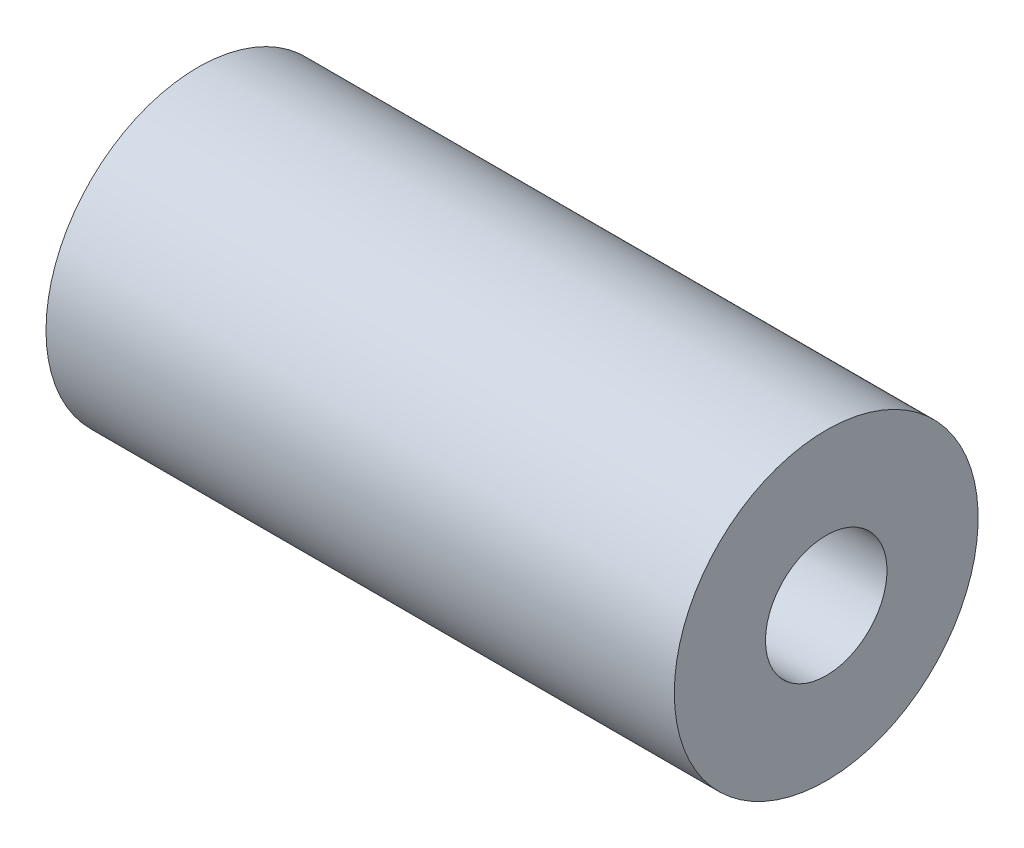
from build123d import *

# Parameters (mm, degrees)
SCHIZZO1_W = 51.7
SCHIZZO1_H = 7.5


with BuildPart() as part:
    # Schizzo1 → Rivoluzione1 (revolve)
    with BuildSketch(Plane.XY, mode=Mode.PRIVATE) as rivoluzione1_sk:
        with Locations((7.469823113, 8.75)):
            Rectangle(SCHIZZO1_W, SCHIZZO1_H)
    revolve(rivoluzione1_sk.sketch.rotate(Axis((-25.572018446, 0, 0), (1, 0, 0)), 90), axis=Axis((-25.572018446, 0, 0), (1, 0, 0)))


solid = part.part
